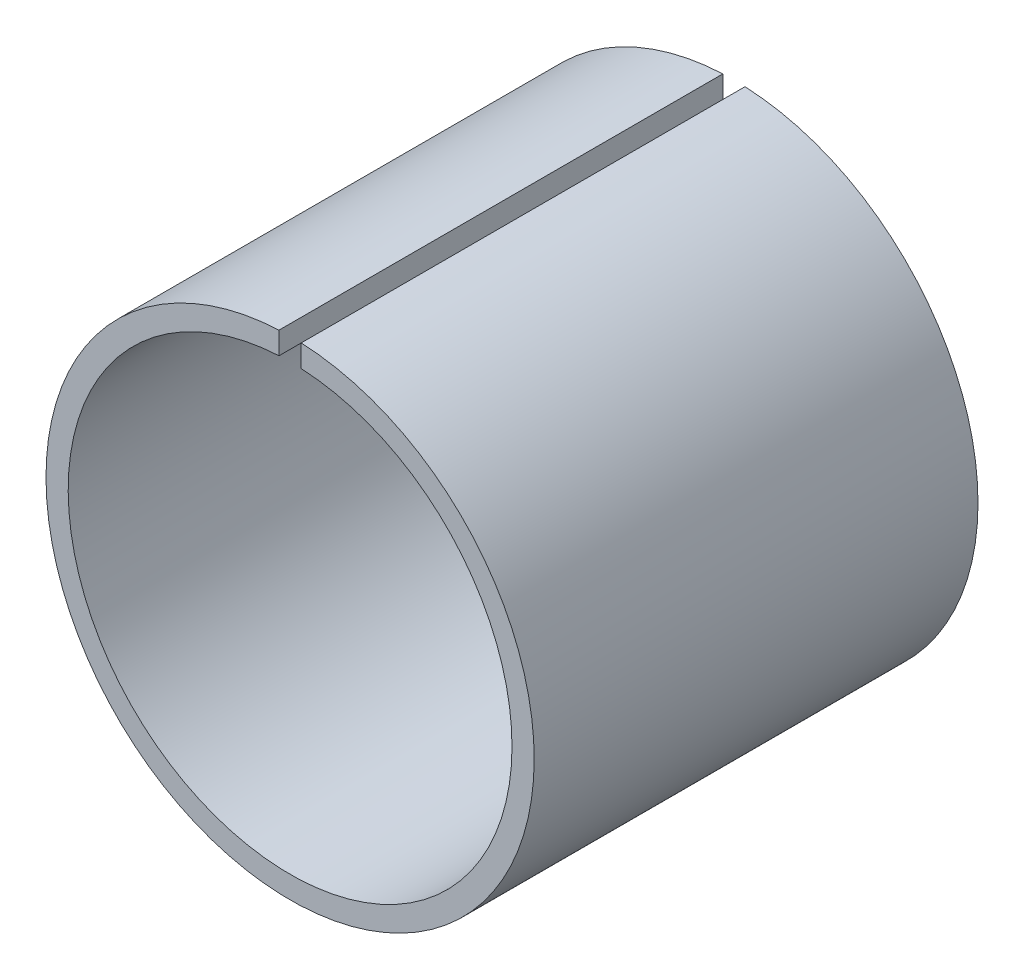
ISO-10303-21;
HEADER;
FILE_DESCRIPTION(('STEP AP214'),'2;1');
FILE_NAME('part.step','',(''),(''),'','','');
FILE_SCHEMA(('AUTOMOTIVE_DESIGN { 1 0 10303 214 1 1 1 1 }'));
ENDSEC;
DATA;
#1=APPLICATION_CONTEXT('core data for automotive mechanical design processes');
#2=APPLICATION_PROTOCOL_DEFINITION('international standard','automotive_design',2000,#1);
#3=PRODUCT_CONTEXT('',#1,'mechanical');
#4=PRODUCT('Part','Part','',(#3));
#5=PRODUCT_RELATED_PRODUCT_CATEGORY('part','',(#4));
#6=PRODUCT_DEFINITION_FORMATION('','',#4);
#7=PRODUCT_DEFINITION_CONTEXT('part definition',#1,'design');
#8=PRODUCT_DEFINITION('design','',#6,#7);
#9=PRODUCT_DEFINITION_SHAPE('','',#8);
#10=(LENGTH_UNIT() NAMED_UNIT(*) SI_UNIT(.MILLI.,.METRE.));
#11=(NAMED_UNIT(*) PLANE_ANGLE_UNIT() SI_UNIT($,.RADIAN.));
#12=(NAMED_UNIT(*) SI_UNIT($,.STERADIAN.) SOLID_ANGLE_UNIT());
#13=UNCERTAINTY_MEASURE_WITH_UNIT(LENGTH_MEASURE(1.E-05),#10,'distance_accuracy_value','');
#14=(GEOMETRIC_REPRESENTATION_CONTEXT(3) GLOBAL_UNCERTAINTY_ASSIGNED_CONTEXT((#13)) GLOBAL_UNIT_ASSIGNED_CONTEXT((#10,
#11,#12)) REPRESENTATION_CONTEXT('',''));
#15=CARTESIAN_POINT('',(0.,0.,0.));
#16=DIRECTION('',(0.,0.,1.));
#17=DIRECTION('',(1.,0.,0.));
#18=AXIS2_PLACEMENT_3D('',#15,#16,#17);
#19=CARTESIAN_POINT('',(0.,0.,-100.));
#20=DIRECTION('',(0.,0.,1.));
#21=DIRECTION('',(1.,0.,0.));
#22=AXIS2_PLACEMENT_3D('',#19,#20,#21);
#23=CYLINDRICAL_SURFACE('',#22,55.);
#24=DIRECTION('',(0.,0.,1.));
#25=VECTOR('',#24,1.);
#26=CARTESIAN_POINT('',(2.5,54.9431524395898,-100.));
#27=LINE('',#26,#25);
#28=CARTESIAN_POINT('',(2.5,54.9431524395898,-100.));
#29=VERTEX_POINT('',#28);
#30=CARTESIAN_POINT('',(2.5,54.9431524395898,0.));
#31=VERTEX_POINT('',#30);
#32=EDGE_CURVE('E91',#29,#31,#27,.T.);
#33=ORIENTED_EDGE('',*,*,#32,.T.);
#34=CARTESIAN_POINT('',(0.,0.,0.));
#35=DIRECTION('',(0.,0.,1.));
#36=DIRECTION('',(1.,0.,0.));
#37=AXIS2_PLACEMENT_3D('',#34,#35,#36);
#38=CIRCLE('',#37,55.);
#39=CARTESIAN_POINT('',(-2.5,54.9431524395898,0.));
#40=VERTEX_POINT('',#39);
#41=EDGE_CURVE('E34',#40,#31,#38,.T.);
#42=ORIENTED_EDGE('',*,*,#41,.F.);
#43=DIRECTION('',(0.,0.,1.));
#44=VECTOR('',#43,1.);
#45=CARTESIAN_POINT('',(-2.5,54.9431524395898,-100.));
#46=LINE('',#45,#44);
#47=CARTESIAN_POINT('',(-2.5,54.9431524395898,-100.));
#48=VERTEX_POINT('',#47);
#49=EDGE_CURVE('E72',#48,#40,#46,.T.);
#50=ORIENTED_EDGE('',*,*,#49,.F.);
#51=CARTESIAN_POINT('',(0.,0.,-100.));
#52=DIRECTION('',(0.,0.,1.));
#53=DIRECTION('',(1.,0.,0.));
#54=AXIS2_PLACEMENT_3D('',#51,#52,#53);
#55=CIRCLE('',#54,55.);
#56=EDGE_CURVE('E11',#48,#29,#55,.T.);
#57=ORIENTED_EDGE('',*,*,#56,.T.);
#58=EDGE_LOOP('',(#33,#42,#50,#57));
#59=FACE_BOUND('',#58,.T.);
#60=ADVANCED_FACE('F31',(#59),#23,.T.);
#61=CARTESIAN_POINT('',(0.,0.,-100.));
#62=DIRECTION('',(0.,0.,1.));
#63=DIRECTION('',(1.,0.,0.));
#64=AXIS2_PLACEMENT_3D('',#61,#62,#63);
#65=PLANE('',#64);
#66=CARTESIAN_POINT('',(0.,0.,-100.));
#67=DIRECTION('',(0.,0.,1.));
#68=DIRECTION('',(1.,0.,0.));
#69=AXIS2_PLACEMENT_3D('',#66,#67,#68);
#70=CIRCLE('',#69,50.);
#71=CARTESIAN_POINT('',(-2.5,49.9374608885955,-100.));
#72=VERTEX_POINT('',#71);
#73=CARTESIAN_POINT('',(2.5,49.9374608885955,-100.));
#74=VERTEX_POINT('',#73);
#75=EDGE_CURVE('E86',#72,#74,#70,.T.);
#76=ORIENTED_EDGE('',*,*,#75,.T.);
#77=DIRECTION('',(0.,1.,0.));
#78=VECTOR('',#77,1.);
#79=CARTESIAN_POINT('',(2.5,49.9374608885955,-100.));
#80=LINE('',#79,#78);
#81=EDGE_CURVE('E53',#74,#29,#80,.T.);
#82=ORIENTED_EDGE('',*,*,#81,.T.);
#83=ORIENTED_EDGE('',*,*,#56,.F.);
#84=DIRECTION('',(0.,-1.,0.));
#85=VECTOR('',#84,1.);
#86=CARTESIAN_POINT('',(-2.5,49.9374608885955,-100.));
#87=LINE('',#86,#85);
#88=EDGE_CURVE('E69',#48,#72,#87,.T.);
#89=ORIENTED_EDGE('',*,*,#88,.T.);
#90=EDGE_LOOP('',(#76,#82,#83,#89));
#91=FACE_BOUND('',#90,.T.);
#92=ADVANCED_FACE('F85',(#91),#65,.F.);
#93=CARTESIAN_POINT('',(0.,0.,0.));
#94=DIRECTION('',(0.,0.,1.));
#95=DIRECTION('',(1.,0.,0.));
#96=AXIS2_PLACEMENT_3D('',#93,#94,#95);
#97=PLANE('',#96);
#98=DIRECTION('',(0.,1.,0.));
#99=VECTOR('',#98,1.);
#100=CARTESIAN_POINT('',(2.5,49.9374608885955,0.));
#101=LINE('',#100,#99);
#102=CARTESIAN_POINT('',(2.49999999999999,49.9374608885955,0.));
#103=VERTEX_POINT('',#102);
#104=EDGE_CURVE('E78',#103,#31,#101,.T.);
#105=ORIENTED_EDGE('',*,*,#104,.F.);
#106=CARTESIAN_POINT('',(0.,0.,0.));
#107=DIRECTION('',(0.,0.,1.));
#108=DIRECTION('',(1.,0.,0.));
#109=AXIS2_PLACEMENT_3D('',#106,#107,#108);
#110=CIRCLE('',#109,50.);
#111=CARTESIAN_POINT('',(-2.5,49.9374608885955,0.));
#112=VERTEX_POINT('',#111);
#113=EDGE_CURVE('E93',#112,#103,#110,.T.);
#114=ORIENTED_EDGE('',*,*,#113,.F.);
#115=DIRECTION('',(0.,-1.,0.));
#116=VECTOR('',#115,1.);
#117=CARTESIAN_POINT('',(-2.5,49.9374608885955,0.));
#118=LINE('',#117,#116);
#119=EDGE_CURVE('E45',#40,#112,#118,.T.);
#120=ORIENTED_EDGE('',*,*,#119,.F.);
#121=ORIENTED_EDGE('',*,*,#41,.T.);
#122=EDGE_LOOP('',(#105,#114,#120,#121));
#123=FACE_BOUND('',#122,.T.);
#124=ADVANCED_FACE('F104',(#123),#97,.T.);
#125=CARTESIAN_POINT('',(0.,0.,-100.));
#126=DIRECTION('',(0.,0.,1.));
#127=DIRECTION('',(1.,0.,0.));
#128=AXIS2_PLACEMENT_3D('',#125,#126,#127);
#129=CYLINDRICAL_SURFACE('',#128,50.);
#130=ORIENTED_EDGE('',*,*,#113,.T.);
#131=DIRECTION('',(0.,0.,1.));
#132=VECTOR('',#131,1.);
#133=CARTESIAN_POINT('',(2.49999999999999,49.9374608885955,-100.));
#134=LINE('',#133,#132);
#135=EDGE_CURVE('E94',#74,#103,#134,.T.);
#136=ORIENTED_EDGE('',*,*,#135,.F.);
#137=ORIENTED_EDGE('',*,*,#75,.F.);
#138=DIRECTION('',(0.,0.,1.));
#139=VECTOR('',#138,1.);
#140=CARTESIAN_POINT('',(-2.5,49.9374608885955,-100.));
#141=LINE('',#140,#139);
#142=EDGE_CURVE('E73',#72,#112,#141,.T.);
#143=ORIENTED_EDGE('',*,*,#142,.T.);
#144=EDGE_LOOP('',(#130,#136,#137,#143));
#145=FACE_BOUND('',#144,.T.);
#146=ADVANCED_FACE('F101',(#145),#129,.F.);
#147=CARTESIAN_POINT('',(-2.5,49.9374608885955,-100.));
#148=DIRECTION('',(-1.,0.,0.));
#149=DIRECTION('',(0.,0.,1.));
#150=AXIS2_PLACEMENT_3D('',#147,#148,#149);
#151=PLANE('',#150);
#152=ORIENTED_EDGE('',*,*,#119,.T.);
#153=ORIENTED_EDGE('',*,*,#142,.F.);
#154=ORIENTED_EDGE('',*,*,#88,.F.);
#155=ORIENTED_EDGE('',*,*,#49,.T.);
#156=EDGE_LOOP('',(#152,#153,#154,#155));
#157=FACE_BOUND('',#156,.T.);
#158=ADVANCED_FACE('F71',(#157),#151,.F.);
#159=CARTESIAN_POINT('',(2.5,49.9374608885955,-100.));
#160=DIRECTION('',(1.,0.,0.));
#161=DIRECTION('',(0.,0.,-1.));
#162=AXIS2_PLACEMENT_3D('',#159,#160,#161);
#163=PLANE('',#162);
#164=ORIENTED_EDGE('',*,*,#104,.T.);
#165=ORIENTED_EDGE('',*,*,#32,.F.);
#166=ORIENTED_EDGE('',*,*,#81,.F.);
#167=ORIENTED_EDGE('',*,*,#135,.T.);
#168=EDGE_LOOP('',(#164,#165,#166,#167));
#169=FACE_BOUND('',#168,.T.);
#170=ADVANCED_FACE('F105',(#169),#163,.F.);
#171=CLOSED_SHELL('',(#60,#92,#124,#146,#158,#170));
#172=MANIFOLD_SOLID_BREP('B2',#171);
#173=ADVANCED_BREP_SHAPE_REPRESENTATION('',(#18,#172),#14);
#174=SHAPE_DEFINITION_REPRESENTATION(#9,#173);
ENDSEC;
END-ISO-10303-21;
